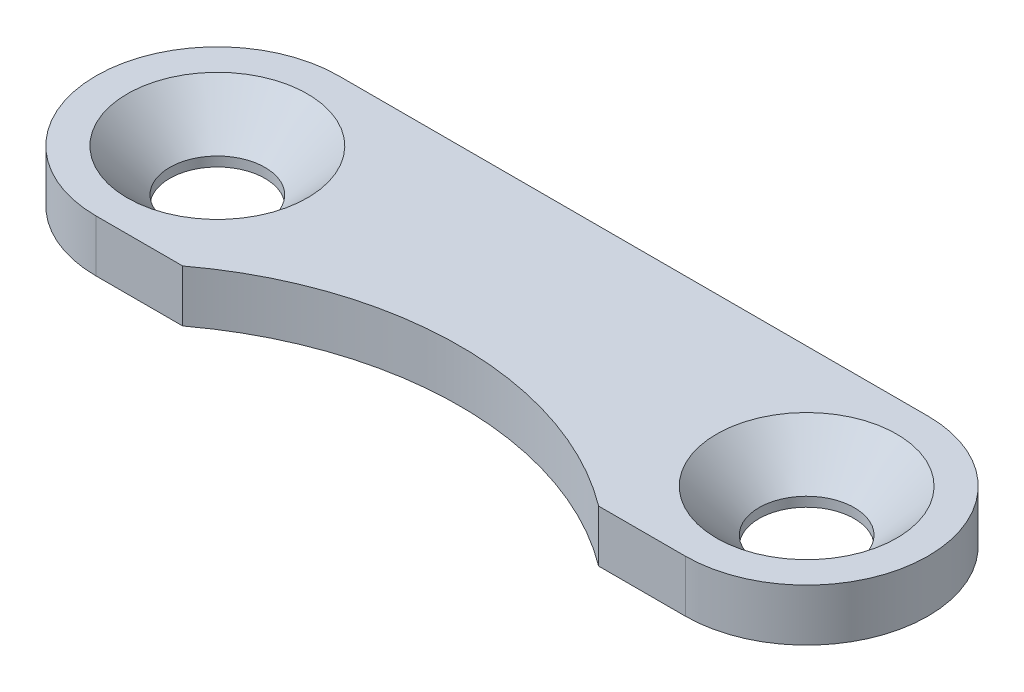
ISO-10303-21;
HEADER;
FILE_DESCRIPTION(('STEP AP214'),'2;1');
FILE_NAME('part.step','',(''),(''),'','','');
FILE_SCHEMA(('AUTOMOTIVE_DESIGN { 1 0 10303 214 1 1 1 1 }'));
ENDSEC;
DATA;
#1=APPLICATION_CONTEXT('core data for automotive mechanical design processes');
#2=APPLICATION_PROTOCOL_DEFINITION('international standard','automotive_design',2000,#1);
#3=PRODUCT_CONTEXT('',#1,'mechanical');
#4=PRODUCT('Part','Part','',(#3));
#5=PRODUCT_RELATED_PRODUCT_CATEGORY('part','',(#4));
#6=PRODUCT_DEFINITION_FORMATION('','',#4);
#7=PRODUCT_DEFINITION_CONTEXT('part definition',#1,'design');
#8=PRODUCT_DEFINITION('design','',#6,#7);
#9=PRODUCT_DEFINITION_SHAPE('','',#8);
#10=(LENGTH_UNIT() NAMED_UNIT(*) SI_UNIT(.MILLI.,.METRE.));
#11=(NAMED_UNIT(*) PLANE_ANGLE_UNIT() SI_UNIT($,.RADIAN.));
#12=(NAMED_UNIT(*) SI_UNIT($,.STERADIAN.) SOLID_ANGLE_UNIT());
#13=UNCERTAINTY_MEASURE_WITH_UNIT(LENGTH_MEASURE(1.E-05),#10,'distance_accuracy_value','');
#14=(GEOMETRIC_REPRESENTATION_CONTEXT(3) GLOBAL_UNCERTAINTY_ASSIGNED_CONTEXT((#13)) GLOBAL_UNIT_ASSIGNED_CONTEXT((#10,
#11,#12)) REPRESENTATION_CONTEXT('',''));
#15=CARTESIAN_POINT('',(0.,0.,0.));
#16=DIRECTION('',(0.,0.,1.));
#17=DIRECTION('',(1.,0.,0.));
#18=AXIS2_PLACEMENT_3D('',#15,#16,#17);
#19=CARTESIAN_POINT('',(-17.,3.,0.));
#20=DIRECTION('',(0.,-1.,0.));
#21=DIRECTION('',(0.,0.,-1.));
#22=AXIS2_PLACEMENT_3D('',#19,#20,#21);
#23=CYLINDRICAL_SURFACE('',#22,7.);
#24=CARTESIAN_POINT('',(-17.,0.,0.));
#25=DIRECTION('',(0.,1.,0.));
#26=DIRECTION('',(0.,0.,1.));
#27=AXIS2_PLACEMENT_3D('',#24,#25,#26);
#28=CIRCLE('',#27,7.);
#29=CARTESIAN_POINT('',(-17.,0.,-7.));
#30=VERTEX_POINT('',#29);
#31=CARTESIAN_POINT('',(-17.,0.,7.));
#32=VERTEX_POINT('',#31);
#33=EDGE_CURVE('E115',#30,#32,#28,.T.);
#34=ORIENTED_EDGE('',*,*,#33,.T.);
#35=DIRECTION('',(0.,-1.,0.));
#36=VECTOR('',#35,1.);
#37=CARTESIAN_POINT('',(-17.,3.,7.));
#38=LINE('',#37,#36);
#39=CARTESIAN_POINT('',(-17.,3.,7.));
#40=VERTEX_POINT('',#39);
#41=EDGE_CURVE('E11',#40,#32,#38,.T.);
#42=ORIENTED_EDGE('',*,*,#41,.F.);
#43=CARTESIAN_POINT('',(-17.,3.,0.));
#44=DIRECTION('',(0.,1.,0.));
#45=DIRECTION('',(0.,0.,1.));
#46=AXIS2_PLACEMENT_3D('',#43,#44,#45);
#47=CIRCLE('',#46,7.);
#48=CARTESIAN_POINT('',(-17.,3.,-7.));
#49=VERTEX_POINT('',#48);
#50=EDGE_CURVE('E126',#49,#40,#47,.T.);
#51=ORIENTED_EDGE('',*,*,#50,.F.);
#52=DIRECTION('',(0.,-1.,0.));
#53=VECTOR('',#52,1.);
#54=CARTESIAN_POINT('',(-17.,3.,-7.));
#55=LINE('',#54,#53);
#56=EDGE_CURVE('E111',#49,#30,#55,.T.);
#57=ORIENTED_EDGE('',*,*,#56,.T.);
#58=EDGE_LOOP('',(#34,#42,#51,#57));
#59=FACE_BOUND('',#58,.T.);
#60=ADVANCED_FACE('F31',(#59),#23,.T.);
#61=CARTESIAN_POINT('',(-12.,3.,7.));
#62=DIRECTION('',(0.,0.,-1.));
#63=DIRECTION('',(-1.,0.,0.));
#64=AXIS2_PLACEMENT_3D('',#61,#62,#63);
#65=PLANE('',#64);
#66=DIRECTION('',(1.,0.,0.));
#67=VECTOR('',#66,1.);
#68=CARTESIAN_POINT('',(-12.,0.,7.));
#69=LINE('',#68,#67);
#70=CARTESIAN_POINT('',(-12.,0.,7.));
#71=VERTEX_POINT('',#70);
#72=EDGE_CURVE('E118',#32,#71,#69,.T.);
#73=ORIENTED_EDGE('',*,*,#72,.T.);
#74=DIRECTION('',(0.,-1.,0.));
#75=VECTOR('',#74,1.);
#76=CARTESIAN_POINT('',(-12.,3.,7.));
#77=LINE('',#76,#75);
#78=CARTESIAN_POINT('',(-12.,3.,7.));
#79=VERTEX_POINT('',#78);
#80=EDGE_CURVE('E39',#79,#71,#77,.T.);
#81=ORIENTED_EDGE('',*,*,#80,.F.);
#82=DIRECTION('',(1.,0.,0.));
#83=VECTOR('',#82,1.);
#84=CARTESIAN_POINT('',(-12.,3.,7.));
#85=LINE('',#84,#83);
#86=EDGE_CURVE('E84',#40,#79,#85,.T.);
#87=ORIENTED_EDGE('',*,*,#86,.F.);
#88=ORIENTED_EDGE('',*,*,#41,.T.);
#89=EDGE_LOOP('',(#73,#81,#87,#88));
#90=FACE_BOUND('',#89,.T.);
#91=ADVANCED_FACE('F151',(#90),#65,.F.);
#92=CARTESIAN_POINT('',(0.,3.,23.));
#93=DIRECTION('',(0.,-1.,0.));
#94=DIRECTION('',(0.,0.,-1.));
#95=AXIS2_PLACEMENT_3D('',#92,#93,#94);
#96=CYLINDRICAL_SURFACE('',#95,20.);
#97=CARTESIAN_POINT('',(0.,0.,23.));
#98=DIRECTION('',(0.,-1.,0.));
#99=DIRECTION('',(0.,0.,1.));
#100=AXIS2_PLACEMENT_3D('',#97,#98,#99);
#101=CIRCLE('',#100,20.);
#102=CARTESIAN_POINT('',(12.,0.,7.));
#103=VERTEX_POINT('',#102);
#104=EDGE_CURVE('E121',#71,#103,#101,.T.);
#105=ORIENTED_EDGE('',*,*,#104,.T.);
#106=DIRECTION('',(0.,-1.,0.));
#107=VECTOR('',#106,1.);
#108=CARTESIAN_POINT('',(12.,3.,7.));
#109=LINE('',#108,#107);
#110=CARTESIAN_POINT('',(12.,3.,7.));
#111=VERTEX_POINT('',#110);
#112=EDGE_CURVE('E106',#111,#103,#109,.T.);
#113=ORIENTED_EDGE('',*,*,#112,.F.);
#114=CARTESIAN_POINT('',(0.,3.,23.));
#115=DIRECTION('',(0.,-1.,0.));
#116=DIRECTION('',(0.,0.,1.));
#117=AXIS2_PLACEMENT_3D('',#114,#115,#116);
#118=CIRCLE('',#117,20.);
#119=EDGE_CURVE('E97',#79,#111,#118,.T.);
#120=ORIENTED_EDGE('',*,*,#119,.F.);
#121=ORIENTED_EDGE('',*,*,#80,.T.);
#122=EDGE_LOOP('',(#105,#113,#120,#121));
#123=FACE_BOUND('',#122,.T.);
#124=ADVANCED_FACE('F132',(#123),#96,.F.);
#125=CARTESIAN_POINT('',(17.,3.,7.));
#126=DIRECTION('',(0.,0.,-1.));
#127=DIRECTION('',(-1.,0.,0.));
#128=AXIS2_PLACEMENT_3D('',#125,#126,#127);
#129=PLANE('',#128);
#130=DIRECTION('',(1.,0.,0.));
#131=VECTOR('',#130,1.);
#132=CARTESIAN_POINT('',(17.,0.,7.));
#133=LINE('',#132,#131);
#134=CARTESIAN_POINT('',(17.,0.,7.));
#135=VERTEX_POINT('',#134);
#136=EDGE_CURVE('E105',#103,#135,#133,.T.);
#137=ORIENTED_EDGE('',*,*,#136,.T.);
#138=DIRECTION('',(0.,-1.,0.));
#139=VECTOR('',#138,1.);
#140=CARTESIAN_POINT('',(17.,3.,7.));
#141=LINE('',#140,#139);
#142=CARTESIAN_POINT('',(17.,3.,7.));
#143=VERTEX_POINT('',#142);
#144=EDGE_CURVE('E102',#143,#135,#141,.T.);
#145=ORIENTED_EDGE('',*,*,#144,.F.);
#146=DIRECTION('',(1.,0.,0.));
#147=VECTOR('',#146,1.);
#148=CARTESIAN_POINT('',(17.,3.,7.));
#149=LINE('',#148,#147);
#150=EDGE_CURVE('E91',#111,#143,#149,.T.);
#151=ORIENTED_EDGE('',*,*,#150,.F.);
#152=ORIENTED_EDGE('',*,*,#112,.T.);
#153=EDGE_LOOP('',(#137,#145,#151,#152));
#154=FACE_BOUND('',#153,.T.);
#155=ADVANCED_FACE('F103',(#154),#129,.F.);
#156=CARTESIAN_POINT('',(17.,3.,0.));
#157=DIRECTION('',(0.,-1.,0.));
#158=DIRECTION('',(0.,0.,-1.));
#159=AXIS2_PLACEMENT_3D('',#156,#157,#158);
#160=CYLINDRICAL_SURFACE('',#159,7.);
#161=CARTESIAN_POINT('',(17.,0.,0.));
#162=DIRECTION('',(0.,1.,0.));
#163=DIRECTION('',(0.,0.,1.));
#164=AXIS2_PLACEMENT_3D('',#161,#162,#163);
#165=CIRCLE('',#164,7.);
#166=CARTESIAN_POINT('',(17.,0.,-7.));
#167=VERTEX_POINT('',#166);
#168=EDGE_CURVE('E70',#135,#167,#165,.T.);
#169=ORIENTED_EDGE('',*,*,#168,.T.);
#170=DIRECTION('',(0.,-1.,0.));
#171=VECTOR('',#170,1.);
#172=CARTESIAN_POINT('',(17.,3.,-7.));
#173=LINE('',#172,#171);
#174=CARTESIAN_POINT('',(17.,3.,-7.));
#175=VERTEX_POINT('',#174);
#176=EDGE_CURVE('E107',#175,#167,#173,.T.);
#177=ORIENTED_EDGE('',*,*,#176,.F.);
#178=CARTESIAN_POINT('',(17.,3.,0.));
#179=DIRECTION('',(0.,1.,0.));
#180=DIRECTION('',(0.,0.,1.));
#181=AXIS2_PLACEMENT_3D('',#178,#179,#180);
#182=CIRCLE('',#181,7.);
#183=EDGE_CURVE('E95',#143,#175,#182,.T.);
#184=ORIENTED_EDGE('',*,*,#183,.F.);
#185=ORIENTED_EDGE('',*,*,#144,.T.);
#186=EDGE_LOOP('',(#169,#177,#184,#185));
#187=FACE_BOUND('',#186,.T.);
#188=ADVANCED_FACE('F109',(#187),#160,.T.);
#189=CARTESIAN_POINT('',(-17.,3.,-7.));
#190=DIRECTION('',(0.,0.,1.));
#191=DIRECTION('',(1.,0.,0.));
#192=AXIS2_PLACEMENT_3D('',#189,#190,#191);
#193=PLANE('',#192);
#194=DIRECTION('',(-1.,0.,0.));
#195=VECTOR('',#194,1.);
#196=CARTESIAN_POINT('',(-17.,0.,-7.));
#197=LINE('',#196,#195);
#198=EDGE_CURVE('E76',#167,#30,#197,.T.);
#199=ORIENTED_EDGE('',*,*,#198,.T.);
#200=ORIENTED_EDGE('',*,*,#56,.F.);
#201=DIRECTION('',(-1.,0.,0.));
#202=VECTOR('',#201,1.);
#203=CARTESIAN_POINT('',(-17.,3.,-7.));
#204=LINE('',#203,#202);
#205=EDGE_CURVE('E47',#175,#49,#204,.T.);
#206=ORIENTED_EDGE('',*,*,#205,.F.);
#207=ORIENTED_EDGE('',*,*,#176,.T.);
#208=EDGE_LOOP('',(#199,#200,#206,#207));
#209=FACE_BOUND('',#208,.T.);
#210=ADVANCED_FACE('F139',(#209),#193,.F.);
#211=CARTESIAN_POINT('',(-17.,3.,0.));
#212=DIRECTION('',(0.,1.,0.));
#213=DIRECTION('',(0.,0.,1.));
#214=AXIS2_PLACEMENT_3D('',#211,#212,#213);
#215=PLANE('',#214);
#216=CARTESIAN_POINT('',(-17.,3.,0.));
#217=DIRECTION('',(0.,1.,0.));
#218=DIRECTION('',(0.,0.,1.));
#219=AXIS2_PLACEMENT_3D('',#216,#217,#218);
#220=CIRCLE('',#219,5.2);
#221=CARTESIAN_POINT('',(-17.,3.,5.2));
#222=VERTEX_POINT('',#221);
#223=EDGE_CURVE('E237',#222,#222,#220,.T.);
#224=ORIENTED_EDGE('',*,*,#223,.F.);
#225=EDGE_LOOP('',(#224));
#226=FACE_BOUND('',#225,.T.);
#227=CARTESIAN_POINT('',(17.,3.,0.));
#228=DIRECTION('',(0.,1.,0.));
#229=DIRECTION('',(0.,0.,1.));
#230=AXIS2_PLACEMENT_3D('',#227,#228,#229);
#231=CIRCLE('',#230,5.2);
#232=CARTESIAN_POINT('',(17.,3.,5.2));
#233=VERTEX_POINT('',#232);
#234=EDGE_CURVE('E244',#233,#233,#231,.T.);
#235=ORIENTED_EDGE('',*,*,#234,.F.);
#236=EDGE_LOOP('',(#235));
#237=FACE_BOUND('',#236,.T.);
#238=ORIENTED_EDGE('',*,*,#50,.T.);
#239=ORIENTED_EDGE('',*,*,#86,.T.);
#240=ORIENTED_EDGE('',*,*,#119,.T.);
#241=ORIENTED_EDGE('',*,*,#150,.T.);
#242=ORIENTED_EDGE('',*,*,#183,.T.);
#243=ORIENTED_EDGE('',*,*,#205,.T.);
#244=EDGE_LOOP('',(#238,#239,#240,#241,#242,#243));
#245=FACE_BOUND('',#244,.T.);
#246=ADVANCED_FACE('F93',(#226,#237,#245),#215,.T.);
#247=CARTESIAN_POINT('',(-17.,0.,0.));
#248=DIRECTION('',(0.,1.,0.));
#249=DIRECTION('',(0.,0.,1.));
#250=AXIS2_PLACEMENT_3D('',#247,#248,#249);
#251=PLANE('',#250);
#252=CARTESIAN_POINT('',(-17.,0.,0.));
#253=DIRECTION('',(0.,1.,0.));
#254=DIRECTION('',(0.,0.,1.));
#255=AXIS2_PLACEMENT_3D('',#252,#253,#254);
#256=CIRCLE('',#255,2.75);
#257=CARTESIAN_POINT('',(-17.,0.,2.75));
#258=VERTEX_POINT('',#257);
#259=EDGE_CURVE('E239',#258,#258,#256,.T.);
#260=ORIENTED_EDGE('',*,*,#259,.T.);
#261=EDGE_LOOP('',(#260));
#262=FACE_BOUND('',#261,.T.);
#263=CARTESIAN_POINT('',(17.,0.,0.));
#264=DIRECTION('',(0.,1.,0.));
#265=DIRECTION('',(0.,0.,1.));
#266=AXIS2_PLACEMENT_3D('',#263,#264,#265);
#267=CIRCLE('',#266,2.75);
#268=CARTESIAN_POINT('',(17.,0.,2.75));
#269=VERTEX_POINT('',#268);
#270=EDGE_CURVE('E119',#269,#269,#267,.T.);
#271=ORIENTED_EDGE('',*,*,#270,.T.);
#272=EDGE_LOOP('',(#271));
#273=FACE_BOUND('',#272,.T.);
#274=ORIENTED_EDGE('',*,*,#33,.F.);
#275=ORIENTED_EDGE('',*,*,#198,.F.);
#276=ORIENTED_EDGE('',*,*,#168,.F.);
#277=ORIENTED_EDGE('',*,*,#136,.F.);
#278=ORIENTED_EDGE('',*,*,#104,.F.);
#279=ORIENTED_EDGE('',*,*,#72,.F.);
#280=EDGE_LOOP('',(#274,#275,#276,#277,#278,#279));
#281=FACE_BOUND('',#280,.T.);
#282=ADVANCED_FACE('F135',(#262,#273,#281),#251,.F.);
#283=CARTESIAN_POINT('',(17.,3.,0.));
#284=DIRECTION('',(0.,1.,0.));
#285=DIRECTION('',(0.,0.,1.));
#286=AXIS2_PLACEMENT_3D('',#283,#284,#285);
#287=CYLINDRICAL_SURFACE('',#286,2.75);
#288=ORIENTED_EDGE('',*,*,#270,.F.);
#289=EDGE_LOOP('',(#288));
#290=FACE_BOUND('',#289,.T.);
#291=CARTESIAN_POINT('',(17.,0.549999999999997,0.));
#292=DIRECTION('',(0.,1.,0.));
#293=DIRECTION('',(0.,0.,1.));
#294=AXIS2_PLACEMENT_3D('',#291,#292,#293);
#295=CIRCLE('',#294,2.75);
#296=CARTESIAN_POINT('',(17.,0.549999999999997,2.75));
#297=VERTEX_POINT('',#296);
#298=EDGE_CURVE('E247',#297,#297,#295,.T.);
#299=ORIENTED_EDGE('',*,*,#298,.T.);
#300=EDGE_LOOP('',(#299));
#301=FACE_BOUND('',#300,.T.);
#302=ADVANCED_FACE('F188',(#290,#301),#287,.F.);
#303=CARTESIAN_POINT('',(17.,3.,0.));
#304=DIRECTION('',(0.,1.,0.));
#305=DIRECTION('',(0.,0.,1.));
#306=AXIS2_PLACEMENT_3D('',#303,#304,#305);
#307=CONICAL_SURFACE('',#306,5.2,0.785398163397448);
#308=ORIENTED_EDGE('',*,*,#298,.F.);
#309=EDGE_LOOP('',(#308));
#310=FACE_BOUND('',#309,.T.);
#311=ORIENTED_EDGE('',*,*,#234,.T.);
#312=EDGE_LOOP('',(#311));
#313=FACE_BOUND('',#312,.T.);
#314=ADVANCED_FACE('F197',(#310,#313),#307,.F.);
#315=CARTESIAN_POINT('',(-17.,3.,0.));
#316=DIRECTION('',(0.,1.,0.));
#317=DIRECTION('',(0.,0.,1.));
#318=AXIS2_PLACEMENT_3D('',#315,#316,#317);
#319=CYLINDRICAL_SURFACE('',#318,2.75);
#320=ORIENTED_EDGE('',*,*,#259,.F.);
#321=EDGE_LOOP('',(#320));
#322=FACE_BOUND('',#321,.T.);
#323=CARTESIAN_POINT('',(-17.,0.549999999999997,0.));
#324=DIRECTION('',(0.,1.,0.));
#325=DIRECTION('',(0.,0.,1.));
#326=AXIS2_PLACEMENT_3D('',#323,#324,#325);
#327=CIRCLE('',#326,2.75);
#328=CARTESIAN_POINT('',(-17.,0.549999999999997,2.75));
#329=VERTEX_POINT('',#328);
#330=EDGE_CURVE('E234',#329,#329,#327,.T.);
#331=ORIENTED_EDGE('',*,*,#330,.T.);
#332=EDGE_LOOP('',(#331));
#333=FACE_BOUND('',#332,.T.);
#334=ADVANCED_FACE('F207',(#322,#333),#319,.F.);
#335=CARTESIAN_POINT('',(-17.,3.,0.));
#336=DIRECTION('',(0.,1.,0.));
#337=DIRECTION('',(0.,0.,1.));
#338=AXIS2_PLACEMENT_3D('',#335,#336,#337);
#339=CONICAL_SURFACE('',#338,5.2,0.785398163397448);
#340=ORIENTED_EDGE('',*,*,#330,.F.);
#341=EDGE_LOOP('',(#340));
#342=FACE_BOUND('',#341,.T.);
#343=ORIENTED_EDGE('',*,*,#223,.T.);
#344=EDGE_LOOP('',(#343));
#345=FACE_BOUND('',#344,.T.);
#346=ADVANCED_FACE('F217',(#342,#345),#339,.F.);
#347=CLOSED_SHELL('',(#60,#91,#124,#155,#188,#210,#246,#282,#302,#314,#334,#346));
#348=MANIFOLD_SOLID_BREP('B2',#347);
#349=ADVANCED_BREP_SHAPE_REPRESENTATION('',(#18,#348),#14);
#350=SHAPE_DEFINITION_REPRESENTATION(#9,#349);
ENDSEC;
END-ISO-10303-21;
